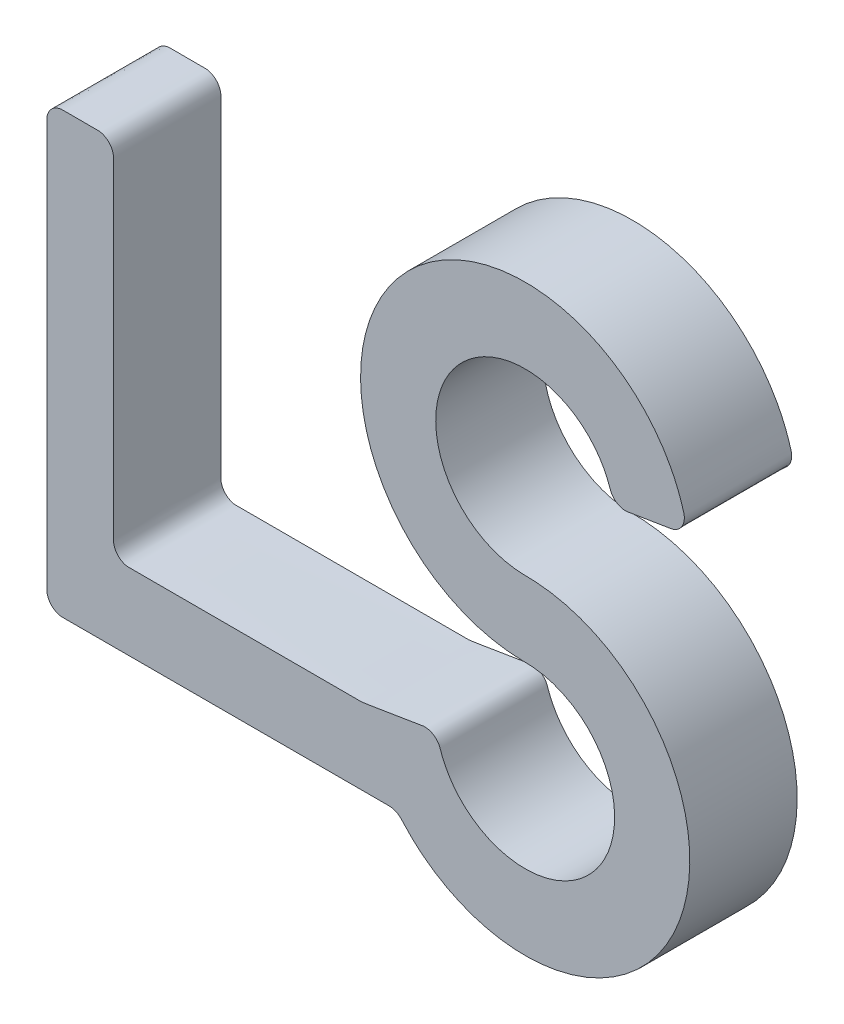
ISO-10303-21;
HEADER;
FILE_DESCRIPTION(('STEP AP214'),'2;1');
FILE_NAME('part.step','',(''),(''),'','','');
FILE_SCHEMA(('AUTOMOTIVE_DESIGN { 1 0 10303 214 1 1 1 1 }'));
ENDSEC;
DATA;
#1=APPLICATION_CONTEXT('core data for automotive mechanical design processes');
#2=APPLICATION_PROTOCOL_DEFINITION('international standard','automotive_design',2000,#1);
#3=PRODUCT_CONTEXT('',#1,'mechanical');
#4=PRODUCT('Part','Part','',(#3));
#5=PRODUCT_RELATED_PRODUCT_CATEGORY('part','',(#4));
#6=PRODUCT_DEFINITION_FORMATION('','',#4);
#7=PRODUCT_DEFINITION_CONTEXT('part definition',#1,'design');
#8=PRODUCT_DEFINITION('design','',#6,#7);
#9=PRODUCT_DEFINITION_SHAPE('','',#8);
#10=(LENGTH_UNIT() NAMED_UNIT(*) SI_UNIT(.MILLI.,.METRE.));
#11=(NAMED_UNIT(*) PLANE_ANGLE_UNIT() SI_UNIT($,.RADIAN.));
#12=(NAMED_UNIT(*) SI_UNIT($,.STERADIAN.) SOLID_ANGLE_UNIT());
#13=UNCERTAINTY_MEASURE_WITH_UNIT(LENGTH_MEASURE(1.E-05),#10,'distance_accuracy_value','');
#14=(GEOMETRIC_REPRESENTATION_CONTEXT(3) GLOBAL_UNCERTAINTY_ASSIGNED_CONTEXT((#13)) GLOBAL_UNIT_ASSIGNED_CONTEXT((#10,
#11,#12)) REPRESENTATION_CONTEXT('',''));
#15=CARTESIAN_POINT('',(0.,0.,0.));
#16=DIRECTION('',(0.,0.,1.));
#17=DIRECTION('',(1.,0.,0.));
#18=AXIS2_PLACEMENT_3D('',#15,#16,#17);
#19=CARTESIAN_POINT('',(12.40888252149,18.3807138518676,-20.));
#20=CARTESIAN_POINT('',(12.40888252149,38.1498272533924,-20.));
#21=CARTESIAN_POINT('',(12.40888252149,57.9189406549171,-20.));
#22=CARTESIAN_POINT('',(12.40888252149,77.6880540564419,-20.));
#23=CARTESIAN_POINT('',(12.40888252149,77.8181142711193,-20.));
#24=CARTESIAN_POINT('',(12.40888252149,78.0782347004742,-20.));
#25=CARTESIAN_POINT('',(12.40888252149,78.4684153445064,-20.));
#26=CARTESIAN_POINT('',(12.40888252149,78.7285357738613,-20.));
#27=CARTESIAN_POINT('',(12.40888252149,78.8585959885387,-20.));
#28=CARTESIAN_POINT('',(12.40888252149,78.9886562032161,-20.));
#29=CARTESIAN_POINT('',(12.40888252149,79.248776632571,-20.));
#30=CARTESIAN_POINT('',(12.3142087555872,79.6396930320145,-20.));
#31=CARTESIAN_POINT('',(12.2302930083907,79.8864863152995,-20.));
#32=CARTESIAN_POINT('',(12.1805211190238,80.006646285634,-20.));
#33=CARTESIAN_POINT('',(11.8719698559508,80.7515549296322,-20.));
#34=CARTESIAN_POINT('',(11.3018414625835,81.3216833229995,-20.));
#35=CARTESIAN_POINT('',(10.5569328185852,81.6302345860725,-20.));
#36=CARTESIAN_POINT('',(10.4367728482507,81.6800064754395,-20.));
#37=CARTESIAN_POINT('',(10.1899795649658,81.7639222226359,-20.));
#38=CARTESIAN_POINT('',(9.79906316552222,81.8585959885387,-20.));
#39=CARTESIAN_POINT('',(9.53894273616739,81.8585959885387,-20.));
#40=CARTESIAN_POINT('',(9.40888252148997,81.8585959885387,-20.));
#41=CARTESIAN_POINT('',(9.23085800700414,81.8585959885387,-20.));
#42=CARTESIAN_POINT('',(8.87480897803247,81.8585959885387,-20.));
#43=CARTESIAN_POINT('',(8.34073543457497,81.8585959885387,-20.));
#44=CARTESIAN_POINT('',(7.9846864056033,81.8585959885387,-20.));
#45=CARTESIAN_POINT('',(7.80666189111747,81.8585959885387,-20.));
#46=CARTESIAN_POINT('',(6.73851480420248,81.8585959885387,-20.));
#47=CARTESIAN_POINT('',(5.67036771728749,81.8585959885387,-20.));
#48=CARTESIAN_POINT('',(4.6022206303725,81.8585959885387,-20.));
#49=CARTESIAN_POINT('',(4.42419611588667,81.8585959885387,-20.));
#50=CARTESIAN_POINT('',(4.068147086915,81.8585959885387,-20.));
#51=CARTESIAN_POINT('',(3.5340735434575,81.8585959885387,-20.));
#52=CARTESIAN_POINT('',(3.17802451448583,81.8585959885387,-20.));
#53=CARTESIAN_POINT('',(3.,81.8585959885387,-20.));
#54=CARTESIAN_POINT('',(2.86993978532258,81.8585959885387,-20.));
#55=CARTESIAN_POINT('',(2.60981935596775,81.8585959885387,-20.));
#56=CARTESIAN_POINT('',(2.21890295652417,81.7639222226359,-20.));
#57=CARTESIAN_POINT('',(1.97210967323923,81.6800064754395,-20.));
#58=CARTESIAN_POINT('',(1.85194970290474,81.6302345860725,-20.));
#59=CARTESIAN_POINT('',(1.1070410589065,81.3216833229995,-20.));
#60=CARTESIAN_POINT('',(0.536912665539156,80.7515549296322,-20.));
#61=CARTESIAN_POINT('',(0.228361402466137,80.0066462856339,-20.));
#62=CARTESIAN_POINT('',(0.178589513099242,79.8864863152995,-20.));
#63=CARTESIAN_POINT('',(0.0946737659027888,79.6396930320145,-20.));
#64=CARTESIAN_POINT('',(0.,79.2487766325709,-20.));
#65=CARTESIAN_POINT('',(0.,78.9886562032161,-20.));
#66=CARTESIAN_POINT('',(0.,78.8585959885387,-20.));
#67=CARTESIAN_POINT('',(0.,78.7285357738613,-20.));
#68=CARTESIAN_POINT('',(0.,78.4684153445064,-20.));
#69=CARTESIAN_POINT('',(0.,78.0782347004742,-20.));
#70=CARTESIAN_POINT('',(0.,77.8181142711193,-20.));
#71=CARTESIAN_POINT('',(0.,77.6880540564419,-20.));
#72=CARTESIAN_POINT('',(0.,53.1822166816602,-20.));
#73=CARTESIAN_POINT('',(0.,28.6763793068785,-20.));
#74=CARTESIAN_POINT('',(0.,4.1705419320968,-20.));
#75=CARTESIAN_POINT('',(0.,4.04048171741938,-20.));
#76=CARTESIAN_POINT('',(0.,3.78036128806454,-20.));
#77=CARTESIAN_POINT('',(0.,3.39018064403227,-20.));
#78=CARTESIAN_POINT('',(0.,3.13006021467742,-20.));
#79=CARTESIAN_POINT('',(0.,3.,-20.));
#80=CARTESIAN_POINT('',(0.,2.86993978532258,-20.));
#81=CARTESIAN_POINT('',(0.,2.60981935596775,-20.));
#82=CARTESIAN_POINT('',(0.0946737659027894,2.21890295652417,-20.));
#83=CARTESIAN_POINT('',(0.178589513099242,1.97210967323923,-20.));
#84=CARTESIAN_POINT('',(0.228361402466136,1.85194970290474,-20.));
#85=CARTESIAN_POINT('',(0.536912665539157,1.1070410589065,-20.));
#86=CARTESIAN_POINT('',(1.1070410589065,0.536912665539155,-20.));
#87=CARTESIAN_POINT('',(1.85194970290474,0.228361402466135,-20.));
#88=CARTESIAN_POINT('',(1.97210967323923,0.178589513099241,-20.));
#89=CARTESIAN_POINT('',(2.21890295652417,0.0946737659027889,-20.));
#90=CARTESIAN_POINT('',(2.60981935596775,0.,-20.));
#91=CARTESIAN_POINT('',(2.86993978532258,0.,-20.));
#92=CARTESIAN_POINT('',(3.,0.,-20.));
#93=CARTESIAN_POINT('',(3.13006021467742,0.,-20.));
#94=CARTESIAN_POINT('',(3.39018064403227,0.,-20.));
#95=CARTESIAN_POINT('',(3.78036128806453,0.,-20.));
#96=CARTESIAN_POINT('',(4.04048171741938,0.,-20.));
#97=CARTESIAN_POINT('',(4.1705419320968,0.,-20.));
#98=CARTESIAN_POINT('',(22.3944014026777,0.,-20.));
#99=CARTESIAN_POINT('',(40.6182608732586,0.,-20.));
#100=CARTESIAN_POINT('',(58.8421203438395,0.,-20.));
#101=CARTESIAN_POINT('',(60.0767474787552,0.,-20.));
#102=CARTESIAN_POINT('',(61.3113746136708,0.,-20.));
#103=CARTESIAN_POINT('',(62.5460017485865,0.,-20.));
#104=CARTESIAN_POINT('',(62.6831825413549,0.,-20.));
#105=CARTESIAN_POINT('',(62.9575441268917,0.,-20.));
#106=CARTESIAN_POINT('',(63.3690865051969,0.,-20.));
#107=CARTESIAN_POINT('',(63.6434480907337,0.,-20.));
#108=CARTESIAN_POINT('',(63.7806288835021,0.,-20.));
#109=CARTESIAN_POINT('',(63.8514333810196,0.,-20.));
#110=CARTESIAN_POINT('',(63.9930423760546,0.,-20.));
#111=CARTESIAN_POINT('',(64.2055848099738,-0.0277151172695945,-20.));
#112=CARTESIAN_POINT('',(64.3450580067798,-0.0527244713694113,-20.));
#113=CARTESIAN_POINT('',(64.4142651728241,-0.0676792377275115,-20.));
#114=CARTESIAN_POINT('',(64.8334642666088,-0.158262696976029,-20.));
#115=CARTESIAN_POINT('',(65.2240740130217,-0.335342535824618,-20.));
#116=CARTESIAN_POINT('',(65.5684702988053,-0.590929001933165,-20.));
#117=CARTESIAN_POINT('',(65.6844830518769,-0.677025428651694,-20.));
#118=CARTESIAN_POINT('',(65.9040702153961,-0.865978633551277,-20.));
#119=CARTESIAN_POINT('',(66.1891408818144,-1.19678974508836,-20.));
#120=CARTESIAN_POINT('',(66.3827206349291,-1.41130609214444,-20.));
#121=CARTESIAN_POINT('',(66.480263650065,-1.51787491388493,-20.));
#122=CARTESIAN_POINT('',(82.8984462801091,-19.4552574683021,-20.));
#123=CARTESIAN_POINT('',(106.916983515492,-15.6583794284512,-20.));
#124=CARTESIAN_POINT('',(117.001742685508,6.46861870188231,-20.));
#125=CARTESIAN_POINT('',(127.086501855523,28.5956168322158,-20.));
#126=CARTESIAN_POINT('',(114.195860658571,49.2144864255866,-20.));
#127=CARTESIAN_POINT('',(89.8870915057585,49.8391111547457,-20.));
#128=CARTESIAN_POINT('',(89.7113195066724,49.8436276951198,-20.));
#129=CARTESIAN_POINT('',(89.359697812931,49.8496370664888,-20.));
#130=CARTESIAN_POINT('',(88.8320438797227,49.8485905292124,-20.));
#131=CARTESIAN_POINT('',(88.4805184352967,49.8597985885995,-20.));
#132=CARTESIAN_POINT('',(88.304888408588,49.8681824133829,-20.));
#133=CARTESIAN_POINT('',(73.398576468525,50.5797458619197,-20.));
#134=CARTESIAN_POINT('',(66.8718009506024,64.0000908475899,-20.));
#135=CARTESIAN_POINT('',(75.5158408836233,76.1650007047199,-20.));
#136=CARTESIAN_POINT('',(84.1598808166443,88.3299105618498,-20.));
#137=CARTESIAN_POINT('',(98.9803886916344,86.5814814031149,-20.));
#138=CARTESIAN_POINT('',(104.556242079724,72.7389990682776,-20.));
#139=CARTESIAN_POINT('',(104.646109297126,72.5158968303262,-20.));
#140=CARTESIAN_POINT('',(104.816183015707,72.0658009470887,-20.));
#141=CARTESIAN_POINT('',(105.035090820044,71.3633810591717,-20.));
#142=CARTESIAN_POINT('',(105.288694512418,70.9505435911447,-20.));
#143=CARTESIAN_POINT('',(105.438158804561,70.7620995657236,-20.));
#144=CARTESIAN_POINT('',(105.888108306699,70.1948049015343,-20.));
#145=CARTESIAN_POINT('',(106.506965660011,69.8189148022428,-20.));
#146=CARTESIAN_POINT('',(107.217809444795,69.6811508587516,-20.));
#147=CARTESIAN_POINT('',(107.333181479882,69.6587913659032,-20.));
#148=CARTESIAN_POINT('',(107.566553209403,69.6276307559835,-20.));
#149=CARTESIAN_POINT('',(107.927486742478,69.6088999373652,-20.));
#150=CARTESIAN_POINT('',(108.159409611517,69.6470364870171,-20.));
#151=CARTESIAN_POINT('',(108.275371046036,69.6661047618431,-20.));
#152=CARTESIAN_POINT('',(108.496486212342,69.7024641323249,-20.));
#153=CARTESIAN_POINT('',(108.938716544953,69.7751828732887,-20.));
#154=CARTESIAN_POINT('',(109.602062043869,69.8842609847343,-20.));
#155=CARTESIAN_POINT('',(110.04429237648,69.956979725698,-20.));
#156=CARTESIAN_POINT('',(110.265407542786,69.9933390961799,-20.));
#157=CARTESIAN_POINT('',(111.904861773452,70.2629249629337,-20.));
#158=CARTESIAN_POINT('',(113.544316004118,70.5325108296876,-20.));
#159=CARTESIAN_POINT('',(115.183770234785,70.8020966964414,-20.));
#160=CARTESIAN_POINT('',(115.300630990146,70.8213128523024,-20.));
#161=CARTESIAN_POINT('',(115.534352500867,70.8597451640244,-20.));
#162=CARTESIAN_POINT('',(115.88493476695,70.9173936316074,-20.));
#163=CARTESIAN_POINT('',(116.118656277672,70.9558259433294,-20.));
#164=CARTESIAN_POINT('',(116.235517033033,70.9750420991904,-20.));
#165=CARTESIAN_POINT('',(116.352613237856,70.9942969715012,-20.));
#166=CARTESIAN_POINT('',(116.586805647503,71.0328067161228,-20.));
#167=CARTESIAN_POINT('',(116.925906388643,71.1682066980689,-20.));
#168=CARTESIAN_POINT('',(117.138775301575,71.2741039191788,-20.));
#169=CARTESIAN_POINT('',(117.24170571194,71.3331598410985,-20.));
#170=CARTESIAN_POINT('',(118.051516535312,71.7977856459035,-20.));
#171=CARTESIAN_POINT('',(118.577965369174,72.5688383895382,-20.));
#172=CARTESIAN_POINT('',(118.715848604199,73.492233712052,-20.));
#173=CARTESIAN_POINT('',(118.757693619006,73.7724671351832,-20.));
#174=CARTESIAN_POINT('',(118.76198220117,74.3447903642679,-20.));
#175=CARTESIAN_POINT('',(118.513808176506,75.1901698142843,-20.));
#176=CARTESIAN_POINT('',(118.345933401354,75.7314708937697,-20.));
#177=CARTESIAN_POINT('',(118.25826153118,76.0009062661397,-20.));
#178=CARTESIAN_POINT('',(109.487684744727,102.954861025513,-20.));
#179=CARTESIAN_POINT('',(81.5221321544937,107.577258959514,-20.));
#180=CARTESIAN_POINT('',(64.5446208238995,84.8791796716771,-20.));
#181=CARTESIAN_POINT('',(47.5671094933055,62.1811003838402,-20.));
#182=CARTESIAN_POINT('',(59.9013436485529,36.6604153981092,-20.));
#183=CARTESIAN_POINT('',(88.2350742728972,35.8614139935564,-20.));
#184=CARTESIAN_POINT('',(88.4269859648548,35.8560021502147,-20.));
#185=CARTESIAN_POINT('',(88.8109110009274,35.8487831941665,-20.));
#186=CARTESIAN_POINT('',(89.3870860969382,35.8500655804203,-20.));
#187=CARTESIAN_POINT('',(89.770890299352,35.8368024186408,-20.));
#188=CARTESIAN_POINT('',(89.9626205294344,35.8268573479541,-20.));
#189=CARTESIAN_POINT('',(104.843724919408,35.054972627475,-20.));
#190=CARTESIAN_POINT('',(111.319321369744,21.6344761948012,-20.));
#191=CARTESIAN_POINT('',(102.663096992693,9.50546743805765,-20.));
#192=CARTESIAN_POINT('',(94.0068726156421,-2.62354131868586,-20.));
#193=CARTESIAN_POINT('',(79.2101958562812,-0.862453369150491,-20.));
#194=CARTESIAN_POINT('',(73.642628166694,12.9594590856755,-20.));
#195=CARTESIAN_POINT('',(73.5527609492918,13.1825613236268,-20.));
#196=CARTESIAN_POINT('',(73.3826872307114,13.6326572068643,-20.));
#197=CARTESIAN_POINT('',(73.1637794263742,14.3350770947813,-20.));
#198=CARTESIAN_POINT('',(72.910175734,14.7479145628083,-20.));
#199=CARTESIAN_POINT('',(72.7607114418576,14.9363585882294,-20.));
#200=CARTESIAN_POINT('',(72.3107619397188,15.5036532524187,-20.));
#201=CARTESIAN_POINT('',(71.6919045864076,15.8795433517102,-20.));
#202=CARTESIAN_POINT('',(70.9810608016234,16.0173072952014,-20.));
#203=CARTESIAN_POINT('',(70.865688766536,16.0396667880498,-20.));
#204=CARTESIAN_POINT('',(70.6323170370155,16.0708273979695,-20.));
#205=CARTESIAN_POINT('',(70.2713835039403,16.0895582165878,-20.));
#206=CARTESIAN_POINT('',(70.0394606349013,16.0514216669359,-20.));
#207=CARTESIAN_POINT('',(69.9234992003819,16.0323533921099,-20.));
#208=CARTESIAN_POINT('',(69.8075377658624,16.0132851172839,-20.));
#209=CARTESIAN_POINT('',(69.5756148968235,15.975148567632,-20.));
#210=CARTESIAN_POINT('',(69.2277305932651,15.9179437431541,-20.));
#211=CARTESIAN_POINT('',(68.9958077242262,15.8798071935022,-20.));
#212=CARTESIAN_POINT('',(68.8798462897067,15.8607389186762,-20.));
#213=CARTESIAN_POINT('',(65.6547269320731,15.3304120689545,-20.));
#214=CARTESIAN_POINT('',(62.4296075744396,14.8000852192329,-20.));
#215=CARTESIAN_POINT('',(59.204488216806,14.2697583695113,-20.));
#216=CARTESIAN_POINT('',(59.1910876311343,14.2675548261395,-20.));
#217=CARTESIAN_POINT('',(59.1642864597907,14.2631477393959,-20.));
#218=CARTESIAN_POINT('',(59.1240847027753,14.2565371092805,-20.));
#219=CARTESIAN_POINT('',(59.0972835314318,14.2521300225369,-20.));
#220=CARTESIAN_POINT('',(59.08388294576,14.2499264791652,-20.));
#221=CARTESIAN_POINT('',(59.0704823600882,14.2477229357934,-20.));
#222=CARTESIAN_POINT('',(59.0436811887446,14.2433158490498,-20.));
#223=CARTESIAN_POINT('',(59.0033138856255,14.2377061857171,-20.));
#224=CARTESIAN_POINT('',(58.976377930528,14.2342113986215,-20.));
#225=CARTESIAN_POINT('',(58.9628987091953,14.2325555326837,-20.));
#226=CARTESIAN_POINT('',(58.8819954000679,14.2226168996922,-20.));
#227=CARTESIAN_POINT('',(58.8007544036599,14.215981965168,-20.));
#228=CARTESIAN_POINT('',(58.7193105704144,14.2126617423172,-20.));
#229=CARTESIAN_POINT('',(58.7057412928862,14.2121085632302,-20.));
#230=CARTESIAN_POINT('',(58.6785952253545,14.2111864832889,-20.));
#231=CARTESIAN_POINT('',(58.6378526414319,14.2101719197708,-20.));
#232=CARTESIAN_POINT('',(58.6106915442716,14.2101719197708,-20.));
#233=CARTESIAN_POINT('',(58.5971109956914,14.2101719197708,-20.));
#234=CARTESIAN_POINT('',(58.5835304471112,14.2101719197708,-20.));
#235=CARTESIAN_POINT('',(58.5563693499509,14.2101719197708,-20.));
#236=CARTESIAN_POINT('',(58.5156277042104,14.2101719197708,-20.));
#237=CARTESIAN_POINT('',(58.4884666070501,14.2101719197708,-20.));
#238=CARTESIAN_POINT('',(58.4748860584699,14.2101719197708,-20.));
#239=CARTESIAN_POINT('',(44.5097321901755,14.2101719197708,-20.));
#240=CARTESIAN_POINT('',(30.5445783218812,14.2101719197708,-20.));
#241=CARTESIAN_POINT('',(16.5794244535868,14.2101719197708,-20.));
#242=CARTESIAN_POINT('',(16.4493642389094,14.2101719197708,-20.));
#243=CARTESIAN_POINT('',(16.1892438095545,14.2101719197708,-20.));
#244=CARTESIAN_POINT('',(15.7990631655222,14.2101719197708,-20.));
#245=CARTESIAN_POINT('',(15.5389427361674,14.2101719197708,-20.));
#246=CARTESIAN_POINT('',(15.40888252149,14.2101719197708,-20.));
#247=CARTESIAN_POINT('',(15.2788223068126,14.2101719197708,-20.));
#248=CARTESIAN_POINT('',(15.0187018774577,14.2101719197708,-20.));
#249=CARTESIAN_POINT('',(14.6277854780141,14.3048456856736,-20.));
#250=CARTESIAN_POINT('',(14.3809921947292,14.38876143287,-20.));
#251=CARTESIAN_POINT('',(14.2608322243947,14.4385333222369,-20.));
#252=CARTESIAN_POINT('',(13.5159235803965,14.7470845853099,-20.));
#253=CARTESIAN_POINT('',(12.9457951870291,15.3172129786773,-20.));
#254=CARTESIAN_POINT('',(12.6372439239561,16.0621216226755,-20.));
#255=CARTESIAN_POINT('',(12.5874720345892,16.18228159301,-20.));
#256=CARTESIAN_POINT('',(12.5035562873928,16.429074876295,-20.));
#257=CARTESIAN_POINT('',(12.40888252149,16.8199912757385,-20.));
#258=CARTESIAN_POINT('',(12.40888252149,17.0801117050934,-20.));
#259=CARTESIAN_POINT('',(12.40888252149,17.2101719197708,-20.));
#260=CARTESIAN_POINT('',(12.40888252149,17.3402321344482,-20.));
#261=CARTESIAN_POINT('',(12.40888252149,17.600352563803,-20.));
#262=CARTESIAN_POINT('',(12.40888252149,17.9905332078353,-20.));
#263=CARTESIAN_POINT('',(12.40888252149,18.2506536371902,-20.));
#264=CARTESIAN_POINT('',(12.40888252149,18.3807138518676,-20.));
#265=(BOUNDED_CURVE() B_SPLINE_CURVE(3,(#19,#20,#21,#22,#23,#24,#25,#26,#27,#28,#29,#30,#31,#32,
#33,#34,#35,#36,#37,#38,#39,#40,#41,#42,#43,#44,#45,#46,#47,#48,#49,#50,#51,#52,#53,#54,#55,#56,
#57,#58,#59,#60,#61,#62,#63,#64,#65,#66,#67,#68,#69,#70,#71,#72,#73,#74,#75,#76,#77,#78,#79,#80,
#81,#82,#83,#84,#85,#86,#87,#88,#89,#90,#91,#92,#93,#94,#95,#96,#97,#98,#99,#100,#101,#102,#103,
#104,#105,#106,#107,#108,#109,#110,#111,#112,#113,#114,#115,#116,#117,#118,#119,#120,#121,#122,
#123,#124,#125,#126,#127,#128,#129,#130,#131,#132,#133,#134,#135,#136,#137,#138,#139,#140,#141,
#142,#143,#144,#145,#146,#147,#148,#149,#150,#151,#152,#153,#154,#155,#156,#157,#158,#159,#160,
#161,#162,#163,#164,#165,#166,#167,#168,#169,#170,#171,#172,#173,#174,#175,#176,#177,#178,#179,
#180,#181,#182,#183,#184,#185,#186,#187,#188,#189,#190,#191,#192,#193,#194,#195,#196,#197,#198,
#199,#200,#201,#202,#203,#204,#205,#206,#207,#208,#209,#210,#211,#212,#213,#214,#215,#216,#217,
#218,#219,#220,#221,#222,#223,#224,#225,#226,#227,#228,#229,#230,#231,#232,#233,#234,#235,#236,
#237,#238,#239,#240,#241,#242,#243,#244,#245,#246,#247,#248,#249,#250,#251,#252,#253,#254,#255,
#256,#257,#258,#259,#260,#261,#262,#263,#264),.UNSPECIFIED.,.T.,
.F.) B_SPLINE_CURVE_WITH_KNOTS((4,3,1,1,3,1,1,3,3,1,1,3,1,1,3,3,1,1,3,1,1,3,3,1,1,3,1,1,3,3,1,1,
3,1,1,3,3,1,1,3,1,1,3,3,3,1,1,3,1,1,3,3,1,1,3,3,3,1,1,3,3,3,1,1,3,3,1,1,3,1,1,3,3,1,1,3,1,1,3,3,
1,1,3,3,3,1,1,3,3,3,1,1,3,3,1,1,3,1,1,3,3,1,1,3,1,1,3,3,1,1,3,1,1,3,3,1,1,3,1,1,3,3,1,1,3,1,1,
4),(0.,0.0930387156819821,0.0936508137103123,0.0942629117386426,0.0948750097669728,
0.095487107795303,0.0960992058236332,0.0967113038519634,0.100313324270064,0.100925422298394,
0.101537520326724,0.102149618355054,0.102987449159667,0.103825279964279,0.104663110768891,
0.109690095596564,0.110527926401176,0.111365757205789,0.112203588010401,0.112815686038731,
0.113427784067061,0.114039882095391,0.117641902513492,0.118254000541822,0.118866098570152,
0.119478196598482,0.120090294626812,0.120702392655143,0.121314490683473,0.236645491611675,
0.237257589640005,0.237869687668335,0.238481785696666,0.239093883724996,0.239705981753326,
0.240318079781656,0.243920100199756,0.244532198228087,0.245144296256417,0.245756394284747,
0.246368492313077,0.246980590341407,0.247592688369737,0.333359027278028,0.339169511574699,
0.339815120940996,0.340460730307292,0.341106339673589,0.341439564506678,0.341772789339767,
0.342106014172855,0.344094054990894,0.34477396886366,0.345453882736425,0.346133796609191,
0.426373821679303,0.506613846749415,0.507441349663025,0.508268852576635,0.509096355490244,
0.554969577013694,0.600842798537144,0.601974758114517,0.603106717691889,0.604238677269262,
0.60750515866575,0.608058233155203,0.608611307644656,0.609164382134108,0.610218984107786,
0.611273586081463,0.61232818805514,0.620147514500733,0.620704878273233,0.621262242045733,
0.621819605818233,0.622378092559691,0.622936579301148,0.623495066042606,0.6275963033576,
0.628929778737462,0.630263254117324,0.631596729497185,0.71700360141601,0.802410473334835,
0.803314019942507,0.804217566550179,0.805121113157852,0.85096844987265,0.896815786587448,
0.89794774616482,0.899079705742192,0.900211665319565,0.903478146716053,0.904031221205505,
0.904584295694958,0.905137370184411,0.905690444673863,0.906243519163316,0.906796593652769,
0.92217870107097,0.922242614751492,0.922306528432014,0.922370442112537,0.922434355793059,
0.922498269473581,0.922562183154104,0.92294558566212,0.923009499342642,0.923073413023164,
0.923137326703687,0.923201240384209,0.923265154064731,0.923329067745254,0.989052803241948,
0.989664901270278,0.990276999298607,0.990889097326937,0.991501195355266,0.992113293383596,
0.992725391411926,0.996327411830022,0.996939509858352,0.997551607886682,0.998163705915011,
0.998775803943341,0.99938790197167,1.),
.UNSPECIFIED.) CURVE() GEOMETRIC_REPRESENTATION_ITEM() RATIONAL_B_SPLINE_CURVE((1.,1.,1.,1.,1.,
1.,1.,1.,1.,1.,1.,1.,1.,1.,0.949253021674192,0.949253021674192,1.,1.,1.,1.,1.,1.,1.,1.,1.,1.,1.,
1.,1.,1.,1.,1.,1.,1.,1.,1.,1.,1.,1.,1.,0.94925302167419,0.94925302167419,1.,1.,1.,1.,1.,1.,1.,
1.,1.,1.,1.,1.,1.,1.,1.,1.,1.,1.,1.,1.,1.,1.,1.,1.,0.94925302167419,0.94925302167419,1.,1.,1.,
1.,1.,1.,1.,1.,1.,1.,1.,1.,1.,1.,1.,1.,1.,1.,1.,1.,1.,1.,1.,1.,1.,1.,1.,0.984960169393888,
0.984960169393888,1.,1.,1.,1.,1.,1.,0.70114565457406,0.70114565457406,1.,0.70114565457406,
0.70114565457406,1.,1.,1.,1.,1.,1.,0.653158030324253,0.653158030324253,1.,0.653158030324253,
0.653158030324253,1.,1.,1.,1.,1.,1.,0.958568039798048,0.958568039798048,1.,1.,1.,1.,1.,1.,1.,1.,
1.,1.,1.,1.,1.,1.,1.,1.,1.,1.,1.,1.,1.,1.,1.,1.,0.933387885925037,0.933387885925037,1.,1.,1.,1.,
1.,1.,0.640235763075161,0.640235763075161,1.,0.640235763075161,0.640235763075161,1.,1.,1.,1.,1.,
1.,0.653760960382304,0.653760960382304,1.,0.653760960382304,0.653760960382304,1.,1.,1.,1.,1.,1.,
0.958568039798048,0.958568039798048,1.,1.,1.,1.,1.,1.,1.,1.,1.,1.,1.,1.,1.,1.,1.,1.,1.,1.,1.,1.,
1.,1.,1.,1.,0.999446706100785,0.999446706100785,1.,1.,1.,1.,1.,1.,1.,1.,1.,1.,1.,1.,1.,1.,1.,1.,
1.,1.,1.,1.,1.,1.,1.,1.,0.94925302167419,0.94925302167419,1.,1.,1.,1.,1.,1.,1.,1.,1.,1.,1.)) REPRESENTATION_ITEM(''));
#266=DIRECTION('',(0.,0.,1.));
#267=VECTOR('',#266,1.);
#268=SURFACE_OF_LINEAR_EXTRUSION('',#265,#267);
#269=CARTESIAN_POINT('',(12.40888252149,18.3807138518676,-20.));
#270=VERTEX_POINT('',#269);
#271=EDGE_CURVE('E10',#270,#270,#265,.T.);
#272=ORIENTED_EDGE('',*,*,#271,.T.);
#273=EDGE_LOOP('',(#272));
#274=FACE_BOUND('',#273,.T.);
#275=CARTESIAN_POINT('',(12.40888252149,18.3807138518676,0.));
#276=CARTESIAN_POINT('',(12.40888252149,38.1498272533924,0.));
#277=CARTESIAN_POINT('',(12.40888252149,57.9189406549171,0.));
#278=CARTESIAN_POINT('',(12.40888252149,77.6880540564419,0.));
#279=CARTESIAN_POINT('',(12.40888252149,77.8181142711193,0.));
#280=CARTESIAN_POINT('',(12.40888252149,78.0782347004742,0.));
#281=CARTESIAN_POINT('',(12.40888252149,78.4684153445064,0.));
#282=CARTESIAN_POINT('',(12.40888252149,78.7285357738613,0.));
#283=CARTESIAN_POINT('',(12.40888252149,78.8585959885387,0.));
#284=CARTESIAN_POINT('',(12.40888252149,78.9886562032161,0.));
#285=CARTESIAN_POINT('',(12.40888252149,79.248776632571,0.));
#286=CARTESIAN_POINT('',(12.3142087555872,79.6396930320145,0.));
#287=CARTESIAN_POINT('',(12.2302930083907,79.8864863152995,0.));
#288=CARTESIAN_POINT('',(12.1805211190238,80.006646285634,0.));
#289=CARTESIAN_POINT('',(11.8719698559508,80.7515549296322,0.));
#290=CARTESIAN_POINT('',(11.3018414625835,81.3216833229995,0.));
#291=CARTESIAN_POINT('',(10.5569328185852,81.6302345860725,0.));
#292=CARTESIAN_POINT('',(10.4367728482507,81.6800064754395,0.));
#293=CARTESIAN_POINT('',(10.1899795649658,81.7639222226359,0.));
#294=CARTESIAN_POINT('',(9.79906316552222,81.8585959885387,0.));
#295=CARTESIAN_POINT('',(9.53894273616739,81.8585959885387,0.));
#296=CARTESIAN_POINT('',(9.40888252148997,81.8585959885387,0.));
#297=CARTESIAN_POINT('',(9.23085800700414,81.8585959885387,0.));
#298=CARTESIAN_POINT('',(8.87480897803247,81.8585959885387,0.));
#299=CARTESIAN_POINT('',(8.34073543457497,81.8585959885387,0.));
#300=CARTESIAN_POINT('',(7.9846864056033,81.8585959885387,0.));
#301=CARTESIAN_POINT('',(7.80666189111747,81.8585959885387,0.));
#302=CARTESIAN_POINT('',(6.73851480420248,81.8585959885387,0.));
#303=CARTESIAN_POINT('',(5.67036771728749,81.8585959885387,0.));
#304=CARTESIAN_POINT('',(4.6022206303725,81.8585959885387,0.));
#305=CARTESIAN_POINT('',(4.42419611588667,81.8585959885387,0.));
#306=CARTESIAN_POINT('',(4.068147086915,81.8585959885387,0.));
#307=CARTESIAN_POINT('',(3.5340735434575,81.8585959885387,0.));
#308=CARTESIAN_POINT('',(3.17802451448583,81.8585959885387,0.));
#309=CARTESIAN_POINT('',(3.,81.8585959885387,0.));
#310=CARTESIAN_POINT('',(2.86993978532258,81.8585959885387,0.));
#311=CARTESIAN_POINT('',(2.60981935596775,81.8585959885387,0.));
#312=CARTESIAN_POINT('',(2.21890295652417,81.7639222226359,0.));
#313=CARTESIAN_POINT('',(1.97210967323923,81.6800064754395,0.));
#314=CARTESIAN_POINT('',(1.85194970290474,81.6302345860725,0.));
#315=CARTESIAN_POINT('',(1.1070410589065,81.3216833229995,0.));
#316=CARTESIAN_POINT('',(0.536912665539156,80.7515549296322,0.));
#317=CARTESIAN_POINT('',(0.228361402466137,80.0066462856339,0.));
#318=CARTESIAN_POINT('',(0.178589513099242,79.8864863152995,0.));
#319=CARTESIAN_POINT('',(0.0946737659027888,79.6396930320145,0.));
#320=CARTESIAN_POINT('',(0.,79.2487766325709,0.));
#321=CARTESIAN_POINT('',(0.,78.9886562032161,0.));
#322=CARTESIAN_POINT('',(0.,78.8585959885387,0.));
#323=CARTESIAN_POINT('',(0.,78.7285357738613,0.));
#324=CARTESIAN_POINT('',(0.,78.4684153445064,0.));
#325=CARTESIAN_POINT('',(0.,78.0782347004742,0.));
#326=CARTESIAN_POINT('',(0.,77.8181142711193,0.));
#327=CARTESIAN_POINT('',(0.,77.6880540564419,0.));
#328=CARTESIAN_POINT('',(0.,53.1822166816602,0.));
#329=CARTESIAN_POINT('',(0.,28.6763793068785,0.));
#330=CARTESIAN_POINT('',(0.,4.1705419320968,0.));
#331=CARTESIAN_POINT('',(0.,4.04048171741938,0.));
#332=CARTESIAN_POINT('',(0.,3.78036128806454,0.));
#333=CARTESIAN_POINT('',(0.,3.39018064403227,0.));
#334=CARTESIAN_POINT('',(0.,3.13006021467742,0.));
#335=CARTESIAN_POINT('',(0.,3.,0.));
#336=CARTESIAN_POINT('',(0.,2.86993978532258,0.));
#337=CARTESIAN_POINT('',(0.,2.60981935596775,0.));
#338=CARTESIAN_POINT('',(0.0946737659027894,2.21890295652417,0.));
#339=CARTESIAN_POINT('',(0.178589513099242,1.97210967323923,0.));
#340=CARTESIAN_POINT('',(0.228361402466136,1.85194970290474,0.));
#341=CARTESIAN_POINT('',(0.536912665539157,1.1070410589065,0.));
#342=CARTESIAN_POINT('',(1.1070410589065,0.536912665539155,0.));
#343=CARTESIAN_POINT('',(1.85194970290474,0.228361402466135,0.));
#344=CARTESIAN_POINT('',(1.97210967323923,0.178589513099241,0.));
#345=CARTESIAN_POINT('',(2.21890295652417,0.0946737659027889,0.));
#346=CARTESIAN_POINT('',(2.60981935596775,0.,0.));
#347=CARTESIAN_POINT('',(2.86993978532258,0.,0.));
#348=CARTESIAN_POINT('',(3.,0.,0.));
#349=CARTESIAN_POINT('',(3.13006021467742,0.,0.));
#350=CARTESIAN_POINT('',(3.39018064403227,0.,0.));
#351=CARTESIAN_POINT('',(3.78036128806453,0.,0.));
#352=CARTESIAN_POINT('',(4.04048171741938,0.,0.));
#353=CARTESIAN_POINT('',(4.1705419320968,0.,0.));
#354=CARTESIAN_POINT('',(22.3944014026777,0.,0.));
#355=CARTESIAN_POINT('',(40.6182608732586,0.,0.));
#356=CARTESIAN_POINT('',(58.8421203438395,0.,0.));
#357=CARTESIAN_POINT('',(60.0767474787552,0.,0.));
#358=CARTESIAN_POINT('',(61.3113746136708,0.,0.));
#359=CARTESIAN_POINT('',(62.5460017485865,0.,0.));
#360=CARTESIAN_POINT('',(62.6831825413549,0.,0.));
#361=CARTESIAN_POINT('',(62.9575441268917,0.,0.));
#362=CARTESIAN_POINT('',(63.3690865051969,0.,0.));
#363=CARTESIAN_POINT('',(63.6434480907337,0.,0.));
#364=CARTESIAN_POINT('',(63.7806288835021,0.,0.));
#365=CARTESIAN_POINT('',(63.8514333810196,0.,0.));
#366=CARTESIAN_POINT('',(63.9930423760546,0.,0.));
#367=CARTESIAN_POINT('',(64.2055848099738,-0.0277151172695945,0.));
#368=CARTESIAN_POINT('',(64.3450580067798,-0.0527244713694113,0.));
#369=CARTESIAN_POINT('',(64.4142651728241,-0.0676792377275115,0.));
#370=CARTESIAN_POINT('',(64.8334642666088,-0.158262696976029,0.));
#371=CARTESIAN_POINT('',(65.2240740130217,-0.335342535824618,0.));
#372=CARTESIAN_POINT('',(65.5684702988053,-0.590929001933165,0.));
#373=CARTESIAN_POINT('',(65.6844830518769,-0.677025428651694,0.));
#374=CARTESIAN_POINT('',(65.9040702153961,-0.865978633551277,0.));
#375=CARTESIAN_POINT('',(66.1891408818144,-1.19678974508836,0.));
#376=CARTESIAN_POINT('',(66.3827206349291,-1.41130609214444,0.));
#377=CARTESIAN_POINT('',(66.480263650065,-1.51787491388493,0.));
#378=CARTESIAN_POINT('',(82.8984462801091,-19.4552574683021,0.));
#379=CARTESIAN_POINT('',(106.916983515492,-15.6583794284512,0.));
#380=CARTESIAN_POINT('',(117.001742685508,6.46861870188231,0.));
#381=CARTESIAN_POINT('',(127.086501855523,28.5956168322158,0.));
#382=CARTESIAN_POINT('',(114.195860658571,49.2144864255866,0.));
#383=CARTESIAN_POINT('',(89.8870915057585,49.8391111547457,0.));
#384=CARTESIAN_POINT('',(89.7113195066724,49.8436276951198,0.));
#385=CARTESIAN_POINT('',(89.359697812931,49.8496370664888,0.));
#386=CARTESIAN_POINT('',(88.8320438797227,49.8485905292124,0.));
#387=CARTESIAN_POINT('',(88.4805184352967,49.8597985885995,0.));
#388=CARTESIAN_POINT('',(88.304888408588,49.8681824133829,0.));
#389=CARTESIAN_POINT('',(73.398576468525,50.5797458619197,0.));
#390=CARTESIAN_POINT('',(66.8718009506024,64.0000908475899,0.));
#391=CARTESIAN_POINT('',(75.5158408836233,76.1650007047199,0.));
#392=CARTESIAN_POINT('',(84.1598808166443,88.3299105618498,0.));
#393=CARTESIAN_POINT('',(98.9803886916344,86.5814814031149,0.));
#394=CARTESIAN_POINT('',(104.556242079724,72.7389990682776,0.));
#395=CARTESIAN_POINT('',(104.646109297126,72.5158968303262,0.));
#396=CARTESIAN_POINT('',(104.816183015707,72.0658009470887,0.));
#397=CARTESIAN_POINT('',(105.035090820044,71.3633810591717,0.));
#398=CARTESIAN_POINT('',(105.288694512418,70.9505435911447,0.));
#399=CARTESIAN_POINT('',(105.438158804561,70.7620995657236,0.));
#400=CARTESIAN_POINT('',(105.888108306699,70.1948049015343,0.));
#401=CARTESIAN_POINT('',(106.506965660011,69.8189148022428,0.));
#402=CARTESIAN_POINT('',(107.217809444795,69.6811508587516,0.));
#403=CARTESIAN_POINT('',(107.333181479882,69.6587913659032,0.));
#404=CARTESIAN_POINT('',(107.566553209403,69.6276307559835,0.));
#405=CARTESIAN_POINT('',(107.927486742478,69.6088999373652,0.));
#406=CARTESIAN_POINT('',(108.159409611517,69.6470364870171,0.));
#407=CARTESIAN_POINT('',(108.275371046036,69.6661047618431,0.));
#408=CARTESIAN_POINT('',(108.496486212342,69.7024641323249,0.));
#409=CARTESIAN_POINT('',(108.938716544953,69.7751828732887,0.));
#410=CARTESIAN_POINT('',(109.602062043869,69.8842609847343,0.));
#411=CARTESIAN_POINT('',(110.04429237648,69.956979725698,0.));
#412=CARTESIAN_POINT('',(110.265407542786,69.9933390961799,0.));
#413=CARTESIAN_POINT('',(111.904861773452,70.2629249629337,0.));
#414=CARTESIAN_POINT('',(113.544316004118,70.5325108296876,0.));
#415=CARTESIAN_POINT('',(115.183770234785,70.8020966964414,0.));
#416=CARTESIAN_POINT('',(115.300630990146,70.8213128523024,0.));
#417=CARTESIAN_POINT('',(115.534352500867,70.8597451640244,0.));
#418=CARTESIAN_POINT('',(115.88493476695,70.9173936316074,0.));
#419=CARTESIAN_POINT('',(116.118656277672,70.9558259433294,0.));
#420=CARTESIAN_POINT('',(116.235517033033,70.9750420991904,0.));
#421=CARTESIAN_POINT('',(116.352613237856,70.9942969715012,0.));
#422=CARTESIAN_POINT('',(116.586805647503,71.0328067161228,0.));
#423=CARTESIAN_POINT('',(116.925906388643,71.1682066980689,0.));
#424=CARTESIAN_POINT('',(117.138775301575,71.2741039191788,0.));
#425=CARTESIAN_POINT('',(117.24170571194,71.3331598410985,0.));
#426=CARTESIAN_POINT('',(118.051516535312,71.7977856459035,0.));
#427=CARTESIAN_POINT('',(118.577965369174,72.5688383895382,0.));
#428=CARTESIAN_POINT('',(118.715848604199,73.492233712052,0.));
#429=CARTESIAN_POINT('',(118.757693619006,73.7724671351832,0.));
#430=CARTESIAN_POINT('',(118.76198220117,74.3447903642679,0.));
#431=CARTESIAN_POINT('',(118.513808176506,75.1901698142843,0.));
#432=CARTESIAN_POINT('',(118.345933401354,75.7314708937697,0.));
#433=CARTESIAN_POINT('',(118.25826153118,76.0009062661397,0.));
#434=CARTESIAN_POINT('',(109.487684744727,102.954861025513,0.));
#435=CARTESIAN_POINT('',(81.5221321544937,107.577258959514,0.));
#436=CARTESIAN_POINT('',(64.5446208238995,84.8791796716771,0.));
#437=CARTESIAN_POINT('',(47.5671094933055,62.1811003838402,0.));
#438=CARTESIAN_POINT('',(59.9013436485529,36.6604153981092,0.));
#439=CARTESIAN_POINT('',(88.2350742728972,35.8614139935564,0.));
#440=CARTESIAN_POINT('',(88.4269859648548,35.8560021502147,0.));
#441=CARTESIAN_POINT('',(88.8109110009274,35.8487831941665,0.));
#442=CARTESIAN_POINT('',(89.3870860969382,35.8500655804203,0.));
#443=CARTESIAN_POINT('',(89.770890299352,35.8368024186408,0.));
#444=CARTESIAN_POINT('',(89.9626205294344,35.8268573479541,0.));
#445=CARTESIAN_POINT('',(104.843724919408,35.054972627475,0.));
#446=CARTESIAN_POINT('',(111.319321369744,21.6344761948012,0.));
#447=CARTESIAN_POINT('',(102.663096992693,9.50546743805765,0.));
#448=CARTESIAN_POINT('',(94.0068726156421,-2.62354131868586,0.));
#449=CARTESIAN_POINT('',(79.2101958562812,-0.862453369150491,0.));
#450=CARTESIAN_POINT('',(73.642628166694,12.9594590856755,0.));
#451=CARTESIAN_POINT('',(73.5527609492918,13.1825613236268,0.));
#452=CARTESIAN_POINT('',(73.3826872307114,13.6326572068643,0.));
#453=CARTESIAN_POINT('',(73.1637794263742,14.3350770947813,0.));
#454=CARTESIAN_POINT('',(72.910175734,14.7479145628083,0.));
#455=CARTESIAN_POINT('',(72.7607114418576,14.9363585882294,0.));
#456=CARTESIAN_POINT('',(72.3107619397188,15.5036532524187,0.));
#457=CARTESIAN_POINT('',(71.6919045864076,15.8795433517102,0.));
#458=CARTESIAN_POINT('',(70.9810608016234,16.0173072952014,0.));
#459=CARTESIAN_POINT('',(70.865688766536,16.0396667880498,0.));
#460=CARTESIAN_POINT('',(70.6323170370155,16.0708273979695,0.));
#461=CARTESIAN_POINT('',(70.2713835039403,16.0895582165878,0.));
#462=CARTESIAN_POINT('',(70.0394606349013,16.0514216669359,0.));
#463=CARTESIAN_POINT('',(69.9234992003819,16.0323533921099,0.));
#464=CARTESIAN_POINT('',(69.8075377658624,16.0132851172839,0.));
#465=CARTESIAN_POINT('',(69.5756148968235,15.975148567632,0.));
#466=CARTESIAN_POINT('',(69.2277305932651,15.9179437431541,0.));
#467=CARTESIAN_POINT('',(68.9958077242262,15.8798071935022,0.));
#468=CARTESIAN_POINT('',(68.8798462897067,15.8607389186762,0.));
#469=CARTESIAN_POINT('',(65.6547269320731,15.3304120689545,0.));
#470=CARTESIAN_POINT('',(62.4296075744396,14.8000852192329,0.));
#471=CARTESIAN_POINT('',(59.204488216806,14.2697583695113,0.));
#472=CARTESIAN_POINT('',(59.1910876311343,14.2675548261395,0.));
#473=CARTESIAN_POINT('',(59.1642864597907,14.2631477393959,0.));
#474=CARTESIAN_POINT('',(59.1240847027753,14.2565371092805,0.));
#475=CARTESIAN_POINT('',(59.0972835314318,14.2521300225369,0.));
#476=CARTESIAN_POINT('',(59.08388294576,14.2499264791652,0.));
#477=CARTESIAN_POINT('',(59.0704823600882,14.2477229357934,0.));
#478=CARTESIAN_POINT('',(59.0436811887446,14.2433158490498,0.));
#479=CARTESIAN_POINT('',(59.0033138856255,14.2377061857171,0.));
#480=CARTESIAN_POINT('',(58.976377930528,14.2342113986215,0.));
#481=CARTESIAN_POINT('',(58.9628987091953,14.2325555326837,0.));
#482=CARTESIAN_POINT('',(58.8819954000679,14.2226168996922,0.));
#483=CARTESIAN_POINT('',(58.8007544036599,14.215981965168,0.));
#484=CARTESIAN_POINT('',(58.7193105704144,14.2126617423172,0.));
#485=CARTESIAN_POINT('',(58.7057412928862,14.2121085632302,0.));
#486=CARTESIAN_POINT('',(58.6785952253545,14.2111864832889,0.));
#487=CARTESIAN_POINT('',(58.6378526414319,14.2101719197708,0.));
#488=CARTESIAN_POINT('',(58.6106915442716,14.2101719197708,0.));
#489=CARTESIAN_POINT('',(58.5971109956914,14.2101719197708,0.));
#490=CARTESIAN_POINT('',(58.5835304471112,14.2101719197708,0.));
#491=CARTESIAN_POINT('',(58.5563693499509,14.2101719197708,0.));
#492=CARTESIAN_POINT('',(58.5156277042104,14.2101719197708,0.));
#493=CARTESIAN_POINT('',(58.4884666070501,14.2101719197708,0.));
#494=CARTESIAN_POINT('',(58.4748860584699,14.2101719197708,0.));
#495=CARTESIAN_POINT('',(44.5097321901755,14.2101719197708,0.));
#496=CARTESIAN_POINT('',(30.5445783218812,14.2101719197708,0.));
#497=CARTESIAN_POINT('',(16.5794244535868,14.2101719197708,0.));
#498=CARTESIAN_POINT('',(16.4493642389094,14.2101719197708,0.));
#499=CARTESIAN_POINT('',(16.1892438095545,14.2101719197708,0.));
#500=CARTESIAN_POINT('',(15.7990631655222,14.2101719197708,0.));
#501=CARTESIAN_POINT('',(15.5389427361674,14.2101719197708,0.));
#502=CARTESIAN_POINT('',(15.40888252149,14.2101719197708,0.));
#503=CARTESIAN_POINT('',(15.2788223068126,14.2101719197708,0.));
#504=CARTESIAN_POINT('',(15.0187018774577,14.2101719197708,0.));
#505=CARTESIAN_POINT('',(14.6277854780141,14.3048456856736,0.));
#506=CARTESIAN_POINT('',(14.3809921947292,14.38876143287,0.));
#507=CARTESIAN_POINT('',(14.2608322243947,14.4385333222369,0.));
#508=CARTESIAN_POINT('',(13.5159235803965,14.7470845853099,0.));
#509=CARTESIAN_POINT('',(12.9457951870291,15.3172129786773,0.));
#510=CARTESIAN_POINT('',(12.6372439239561,16.0621216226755,0.));
#511=CARTESIAN_POINT('',(12.5874720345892,16.18228159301,0.));
#512=CARTESIAN_POINT('',(12.5035562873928,16.429074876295,0.));
#513=CARTESIAN_POINT('',(12.40888252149,16.8199912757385,0.));
#514=CARTESIAN_POINT('',(12.40888252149,17.0801117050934,0.));
#515=CARTESIAN_POINT('',(12.40888252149,17.2101719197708,0.));
#516=CARTESIAN_POINT('',(12.40888252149,17.3402321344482,0.));
#517=CARTESIAN_POINT('',(12.40888252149,17.600352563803,0.));
#518=CARTESIAN_POINT('',(12.40888252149,17.9905332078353,0.));
#519=CARTESIAN_POINT('',(12.40888252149,18.2506536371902,0.));
#520=CARTESIAN_POINT('',(12.40888252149,18.3807138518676,0.));
#521=(BOUNDED_CURVE() B_SPLINE_CURVE(3,(#275,#276,#277,#278,#279,#280,#281,#282,#283,#284,#285,
#286,#287,#288,#289,#290,#291,#292,#293,#294,#295,#296,#297,#298,#299,#300,#301,#302,#303,#304,
#305,#306,#307,#308,#309,#310,#311,#312,#313,#314,#315,#316,#317,#318,#319,#320,#321,#322,#323,
#324,#325,#326,#327,#328,#329,#330,#331,#332,#333,#334,#335,#336,#337,#338,#339,#340,#341,#342,
#343,#344,#345,#346,#347,#348,#349,#350,#351,#352,#353,#354,#355,#356,#357,#358,#359,#360,#361,
#362,#363,#364,#365,#366,#367,#368,#369,#370,#371,#372,#373,#374,#375,#376,#377,#378,#379,#380,
#381,#382,#383,#384,#385,#386,#387,#388,#389,#390,#391,#392,#393,#394,#395,#396,#397,#398,#399,
#400,#401,#402,#403,#404,#405,#406,#407,#408,#409,#410,#411,#412,#413,#414,#415,#416,#417,#418,
#419,#420,#421,#422,#423,#424,#425,#426,#427,#428,#429,#430,#431,#432,#433,#434,#435,#436,#437,
#438,#439,#440,#441,#442,#443,#444,#445,#446,#447,#448,#449,#450,#451,#452,#453,#454,#455,#456,
#457,#458,#459,#460,#461,#462,#463,#464,#465,#466,#467,#468,#469,#470,#471,#472,#473,#474,#475,
#476,#477,#478,#479,#480,#481,#482,#483,#484,#485,#486,#487,#488,#489,#490,#491,#492,#493,#494,
#495,#496,#497,#498,#499,#500,#501,#502,#503,#504,#505,#506,#507,#508,#509,#510,#511,#512,#513,
#514,#515,#516,#517,#518,#519,#520),.UNSPECIFIED.,.T.,.F.) B_SPLINE_CURVE_WITH_KNOTS((4,3,1,1,3,
1,1,3,3,1,1,3,1,1,3,3,1,1,3,1,1,3,3,1,1,3,1,1,3,3,1,1,3,1,1,3,3,1,1,3,1,1,3,3,3,1,1,3,1,1,3,3,1,
1,3,3,3,1,1,3,3,3,1,1,3,3,1,1,3,1,1,3,3,1,1,3,1,1,3,3,1,1,3,3,3,1,1,3,3,3,1,1,3,3,1,1,3,1,1,3,3,
1,1,3,1,1,3,3,1,1,3,1,1,3,3,1,1,3,1,1,3,3,1,1,3,1,1,4),(0.,0.0930387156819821,
0.0936508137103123,0.0942629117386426,0.0948750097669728,0.095487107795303,0.0960992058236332,
0.0967113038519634,0.100313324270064,0.100925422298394,0.101537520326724,0.102149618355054,
0.102987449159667,0.103825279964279,0.104663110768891,0.109690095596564,0.110527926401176,
0.111365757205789,0.112203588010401,0.112815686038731,0.113427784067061,0.114039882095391,
0.117641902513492,0.118254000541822,0.118866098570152,0.119478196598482,0.120090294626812,
0.120702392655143,0.121314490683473,0.236645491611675,0.237257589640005,0.237869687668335,
0.238481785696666,0.239093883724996,0.239705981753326,0.240318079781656,0.243920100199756,
0.244532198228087,0.245144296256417,0.245756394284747,0.246368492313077,0.246980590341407,
0.247592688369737,0.333359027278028,0.339169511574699,0.339815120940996,0.340460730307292,
0.341106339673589,0.341439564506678,0.341772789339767,0.342106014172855,0.344094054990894,
0.34477396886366,0.345453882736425,0.346133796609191,0.426373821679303,0.506613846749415,
0.507441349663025,0.508268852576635,0.509096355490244,0.554969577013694,0.600842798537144,
0.601974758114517,0.603106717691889,0.604238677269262,0.60750515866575,0.608058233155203,
0.608611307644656,0.609164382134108,0.610218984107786,0.611273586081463,0.61232818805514,
0.620147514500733,0.620704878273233,0.621262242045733,0.621819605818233,0.622378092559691,
0.622936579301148,0.623495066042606,0.6275963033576,0.628929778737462,0.630263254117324,
0.631596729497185,0.71700360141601,0.802410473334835,0.803314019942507,0.804217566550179,
0.805121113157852,0.85096844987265,0.896815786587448,0.89794774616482,0.899079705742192,
0.900211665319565,0.903478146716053,0.904031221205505,0.904584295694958,0.905137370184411,
0.905690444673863,0.906243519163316,0.906796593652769,0.92217870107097,0.922242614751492,
0.922306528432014,0.922370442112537,0.922434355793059,0.922498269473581,0.922562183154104,
0.92294558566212,0.923009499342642,0.923073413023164,0.923137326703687,0.923201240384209,
0.923265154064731,0.923329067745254,0.989052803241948,0.989664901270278,0.990276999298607,
0.990889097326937,0.991501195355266,0.992113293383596,0.992725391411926,0.996327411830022,
0.996939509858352,0.997551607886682,0.998163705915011,0.998775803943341,0.99938790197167,1.),
.UNSPECIFIED.) CURVE() GEOMETRIC_REPRESENTATION_ITEM() RATIONAL_B_SPLINE_CURVE((1.,1.,1.,1.,1.,
1.,1.,1.,1.,1.,1.,1.,1.,1.,0.949253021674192,0.949253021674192,1.,1.,1.,1.,1.,1.,1.,1.,1.,1.,1.,
1.,1.,1.,1.,1.,1.,1.,1.,1.,1.,1.,1.,1.,0.94925302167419,0.94925302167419,1.,1.,1.,1.,1.,1.,1.,
1.,1.,1.,1.,1.,1.,1.,1.,1.,1.,1.,1.,1.,1.,1.,1.,1.,0.94925302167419,0.94925302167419,1.,1.,1.,
1.,1.,1.,1.,1.,1.,1.,1.,1.,1.,1.,1.,1.,1.,1.,1.,1.,1.,1.,1.,1.,1.,1.,1.,0.984960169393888,
0.984960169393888,1.,1.,1.,1.,1.,1.,0.70114565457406,0.70114565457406,1.,0.70114565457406,
0.70114565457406,1.,1.,1.,1.,1.,1.,0.653158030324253,0.653158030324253,1.,0.653158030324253,
0.653158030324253,1.,1.,1.,1.,1.,1.,0.958568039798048,0.958568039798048,1.,1.,1.,1.,1.,1.,1.,1.,
1.,1.,1.,1.,1.,1.,1.,1.,1.,1.,1.,1.,1.,1.,1.,1.,0.933387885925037,0.933387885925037,1.,1.,1.,1.,
1.,1.,0.640235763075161,0.640235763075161,1.,0.640235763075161,0.640235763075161,1.,1.,1.,1.,1.,
1.,0.653760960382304,0.653760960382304,1.,0.653760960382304,0.653760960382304,1.,1.,1.,1.,1.,1.,
0.958568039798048,0.958568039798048,1.,1.,1.,1.,1.,1.,1.,1.,1.,1.,1.,1.,1.,1.,1.,1.,1.,1.,1.,1.,
1.,1.,1.,1.,0.999446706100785,0.999446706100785,1.,1.,1.,1.,1.,1.,1.,1.,1.,1.,1.,1.,1.,1.,1.,1.,
1.,1.,1.,1.,1.,1.,1.,1.,0.94925302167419,0.94925302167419,1.,1.,1.,1.,1.,1.,1.,1.,1.,1.,1.)) REPRESENTATION_ITEM(''));
#522=CARTESIAN_POINT('',(12.40888252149,18.3807138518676,0.));
#523=VERTEX_POINT('',#522);
#524=EDGE_CURVE('E35',#523,#523,#521,.T.);
#525=ORIENTED_EDGE('',*,*,#524,.F.);
#526=EDGE_LOOP('',(#525));
#527=FACE_BOUND('',#526,.T.);
#528=ADVANCED_FACE('F31',(#274,#527),#268,.T.);
#529=CARTESIAN_POINT('',(94.2332144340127,49.4164200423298,-20.));
#530=DIRECTION('',(0.,0.,-1.));
#531=DIRECTION('',(-1.,0.,0.));
#532=AXIS2_PLACEMENT_3D('',#529,#530,#531);
#533=PLANE('',#532);
#534=ORIENTED_EDGE('',*,*,#271,.F.);
#535=EDGE_LOOP('',(#534));
#536=FACE_BOUND('',#535,.T.);
#537=ADVANCED_FACE('F54',(#536),#533,.T.);
#538=CARTESIAN_POINT('',(94.2332144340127,49.4164200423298,0.));
#539=DIRECTION('',(0.,0.,-1.));
#540=DIRECTION('',(-1.,0.,0.));
#541=AXIS2_PLACEMENT_3D('',#538,#539,#540);
#542=PLANE('',#541);
#543=ORIENTED_EDGE('',*,*,#524,.T.);
#544=EDGE_LOOP('',(#543));
#545=FACE_BOUND('',#544,.T.);
#546=ADVANCED_FACE('F51',(#545),#542,.F.);
#547=CLOSED_SHELL('',(#528,#537,#546));
#548=MANIFOLD_SOLID_BREP('B2',#547);
#549=ADVANCED_BREP_SHAPE_REPRESENTATION('',(#18,#548),#14);
#550=SHAPE_DEFINITION_REPRESENTATION(#9,#549);
ENDSEC;
END-ISO-10303-21;
